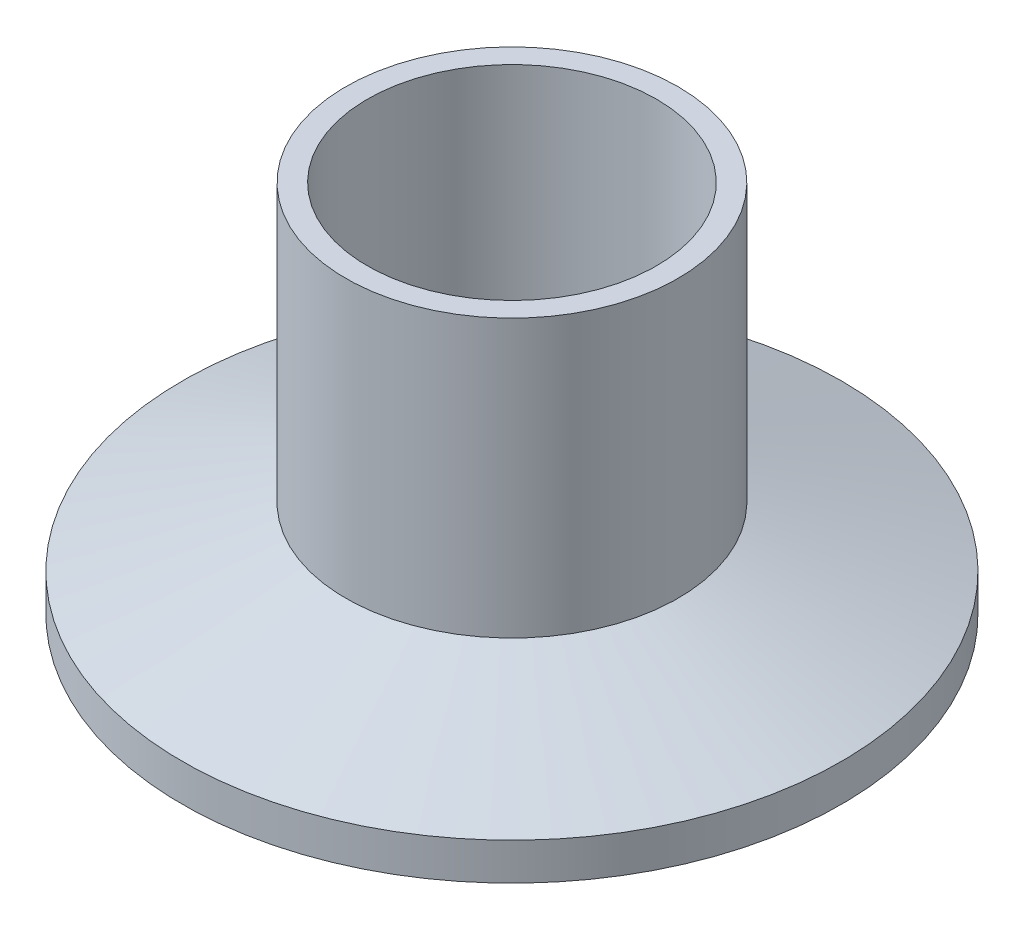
from build123d import *


with BuildPart() as part:
    # Sketch1 → Revolve2 (revolve)
    with BuildSketch(Plane.XY, mode=Mode.PRIVATE) as revolve2_sk:
        with BuildLine():
            Line((-11.049, 0), (-11.049, 28.575))
            Line((-11.049, 28.575), (-12.7, 28.575))
            Line((-12.7, 28.575), (-12.7, 7.393263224))
            Line((-12.7, 7.393263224), (-25.1968, 2.8448))
            Line((-25.1968, 2.8448), (-25.1968, 0))
            Line((-25.1968, 0), (-23.636608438, 0))
            ThreePointArc((-23.636608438, 0), (-23.204411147, 0.129217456), (-22.914066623, 0.474458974))
            ThreePointArc((-22.914066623, 0.474458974), (-21.8186, 1.1938), (-20.723133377, 0.474458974))
            ThreePointArc((-20.723133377, 0.474458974), (-20.432788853, 0.129217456), (-20.000591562, 0))
            Line((-20.000591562, 0), (-11.049, 0))
        make_face()
    revolve(revolve2_sk.sketch.rotate(Axis((0, 0, 0), (0, 1, 0)), 270), axis=Axis((0, 0, 0), (0, 1, 0)))


solid = part.part
